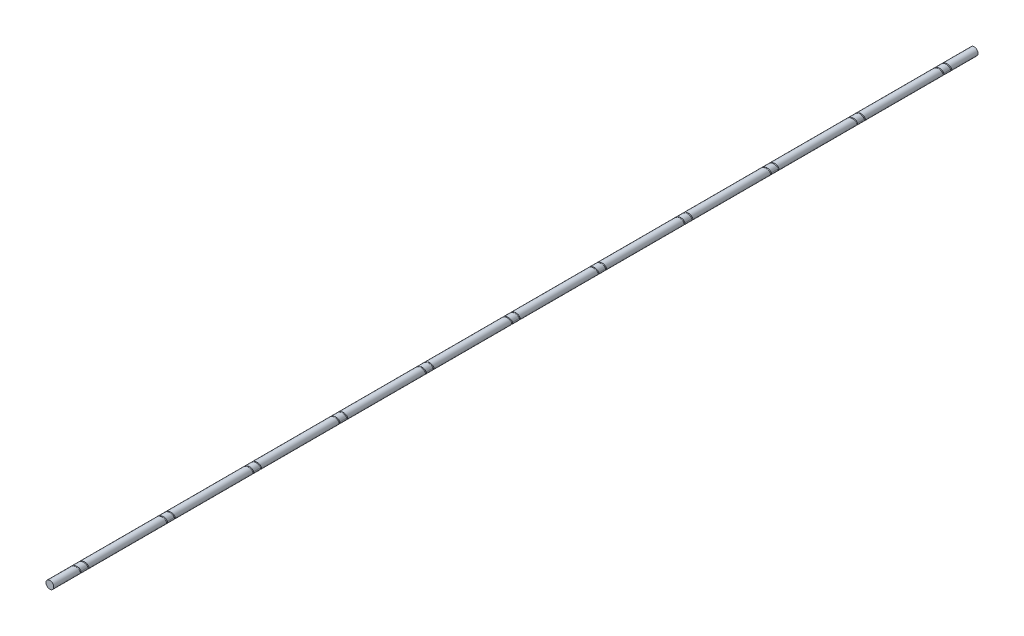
from build123d import *

# Parameters (mm, degrees)
SKETCH1_R              = 25
BOSS_EXTRUDE1_DEPTH    = 6000
CUT_SWEEP1_PITCH       = 50
CUT_SWEEP1_HEIGHT      = 100
CUT_SWEEP1_RADIUS      = 27.646
CUT_SWEEP1_START_ANGLE = -180
SKETCH3_R              = 3.969
LPATTERN1_COUNT        = 11
LPATTERN1_PITCH        = 560


with BuildPart() as part:
    # Sketch1 → Boss-Extrude1 (new body)
    with BuildSketch(Plane.XY):
        Circle(SKETCH1_R)
    extrude(amount=BOSS_EXTRUDE1_DEPTH)

    # Cut-Sweep1: sweep along a helix
    with BuildLine() as cut_sweep1_path:
        add(Helix(CUT_SWEEP1_PITCH, CUT_SWEEP1_HEIGHT, CUT_SWEEP1_RADIUS, center=(0, 0, 150), direction=(0, 0, 1), mode=Mode.PRIVATE).rotate(Axis((0, 0, 150), (0, 0, 1)), CUT_SWEEP1_START_ANGLE))
    # Sketch3 → Cut-Sweep1 (sweep, cut)
    with BuildSketch(Plane(origin=(0, 0, 0), x_dir=(1, 0, 0), z_dir=(0, 1, 0))):
        with Locations((-27.646, -150)):
            Circle(SKETCH3_R)
    cut_sweep1 = sweep(path=cut_sweep1_path.line, is_frenet=True, mode=Mode.SUBTRACT)

    # LPattern1: Cut-Sweep1 ×11
    with Locations(*[(0, 0, i * LPATTERN1_PITCH) for i in range(1, LPATTERN1_COUNT)]):
        add(cut_sweep1, mode=Mode.SUBTRACT)


solid = part.part
